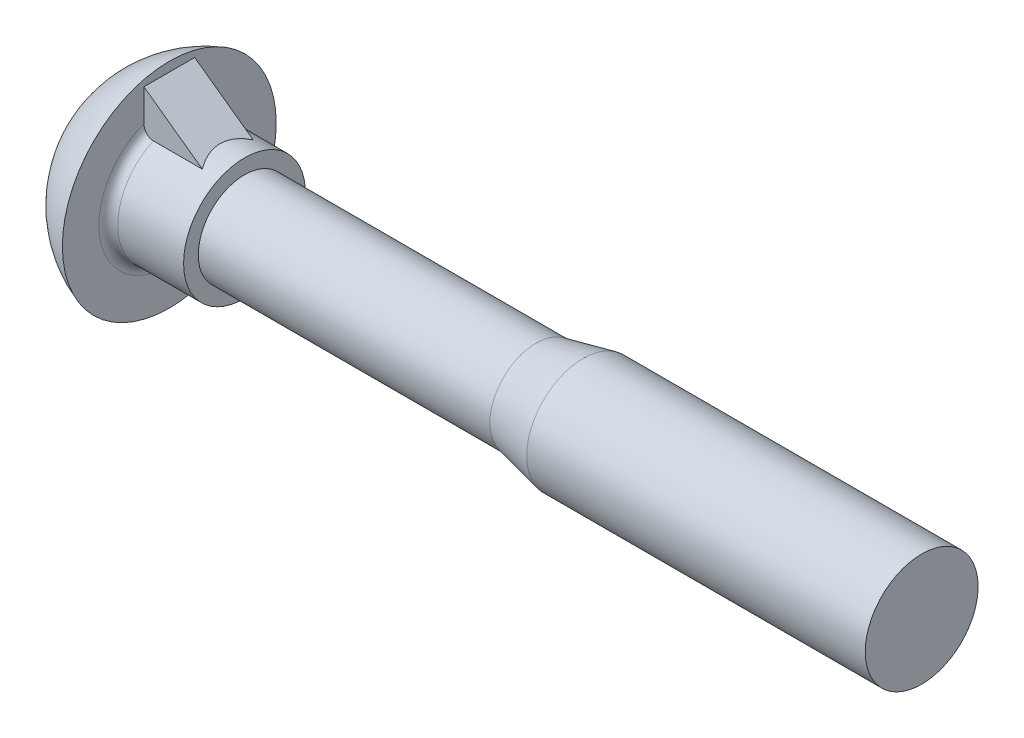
from build123d import *

# Parameters (mm, degrees)
NIB_REACH      = 46.807
SKETCH2_WALL_W = 94.941468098
SKETCH2_WALL_H = 2.7


with BuildPart() as part:
    # Sketch1 → Base (revolve)
    with BuildSketch(Plane.XY, mode=Mode.PRIVATE) as base_sk:
        with BuildLine():
            Line((44.08, 0), (44.08, 3))
            Line((44.08, 3), (8.08, 3))
            Line((8.08, 3), (8.08, 3.24))
            Line((8.08, 3.24), (4.58, 3.24))
            ThreePointArc((4.58, 3.24), (4.226446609, 3.386446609), (4.08, 3.74))
            Line((4.08, 3.74), (4.08, 5.684505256))
            ThreePointArc((4.08, 5.684505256), (1.125576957, 3.498571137), (0, 0))
            Line((0, 0), (44.08, 0))
        make_face()
    revolve(base_sk.sketch.rotate(Axis((-31.484345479, 0, 0), (1, 0, 0)), 90), axis=Axis((-31.484345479, 0, 0), (1, 0, 0)))

    # Sketch2 wall → Nib (add, up to next)
    with BuildSketch(Plane(origin=(5.43, 4.212252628, 0), x_dir=(-0.811462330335, 0.58440472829, 0), z_dir=(-0.58440472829, -0.811462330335, 0)), mode=Mode.PRIVATE) as nib_sk1:
        Rectangle(SKETCH2_WALL_W, SKETCH2_WALL_H)
    nib_tool1 = extrude(nib_sk1.sketch, amount=NIB_REACH, mode=Mode.PRIVATE) - part.part
    add(nib_tool1.solids().sort_by_distance((5.43, 4.212252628, 0))[0])

    # Sketch3 → Cut-Revolve1 (revolve, cut)
    with BuildSketch(Plane.XY, mode=Mode.PRIVATE) as cut_revolve1_sk:
        Polygon((26.08, 3), (23.58, 2.4585), (8.08, 2.4585), (8.08, 3), align=None)
    revolve(cut_revolve1_sk.sketch.rotate(Axis((-29.816341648, 0, 0), (1, 0, 0)), 90), axis=Axis((-29.816341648, 0, 0), (1, 0, 0)), mode=Mode.SUBTRACT)


solid = part.part
